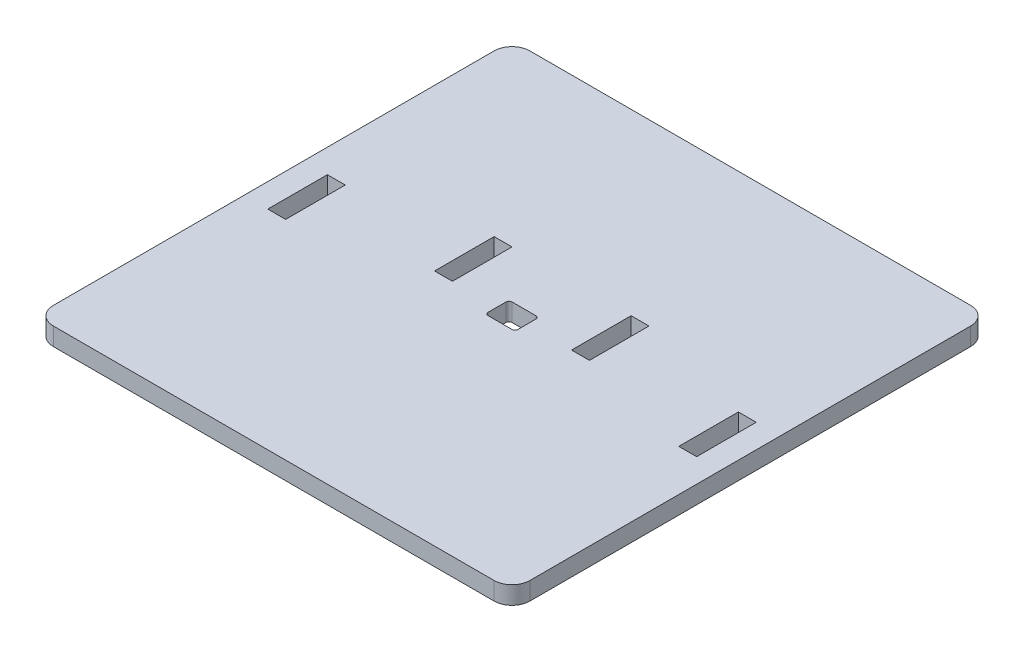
ISO-10303-21;
HEADER;
FILE_DESCRIPTION(('STEP AP214'),'2;1');
FILE_NAME('part.step','',(''),(''),'','','');
FILE_SCHEMA(('AUTOMOTIVE_DESIGN { 1 0 10303 214 1 1 1 1 }'));
ENDSEC;
DATA;
#1=APPLICATION_CONTEXT('core data for automotive mechanical design processes');
#2=APPLICATION_PROTOCOL_DEFINITION('international standard','automotive_design',2000,#1);
#3=PRODUCT_CONTEXT('',#1,'mechanical');
#4=PRODUCT('Part','Part','',(#3));
#5=PRODUCT_RELATED_PRODUCT_CATEGORY('part','',(#4));
#6=PRODUCT_DEFINITION_FORMATION('','',#4);
#7=PRODUCT_DEFINITION_CONTEXT('part definition',#1,'design');
#8=PRODUCT_DEFINITION('design','',#6,#7);
#9=PRODUCT_DEFINITION_SHAPE('','',#8);
#10=(LENGTH_UNIT() NAMED_UNIT(*) SI_UNIT(.MILLI.,.METRE.));
#11=(NAMED_UNIT(*) PLANE_ANGLE_UNIT() SI_UNIT($,.RADIAN.));
#12=(NAMED_UNIT(*) SI_UNIT($,.STERADIAN.) SOLID_ANGLE_UNIT());
#13=UNCERTAINTY_MEASURE_WITH_UNIT(LENGTH_MEASURE(1.E-05),#10,'distance_accuracy_value','');
#14=(GEOMETRIC_REPRESENTATION_CONTEXT(3) GLOBAL_UNCERTAINTY_ASSIGNED_CONTEXT((#13)) GLOBAL_UNIT_ASSIGNED_CONTEXT((#10,
#11,#12)) REPRESENTATION_CONTEXT('',''));
#15=CARTESIAN_POINT('',(0.,0.,0.));
#16=DIRECTION('',(0.,0.,1.));
#17=DIRECTION('',(1.,0.,0.));
#18=AXIS2_PLACEMENT_3D('',#15,#16,#17);
#19=CARTESIAN_POINT('',(74.,6.,-154.));
#20=DIRECTION('',(0.,-1.,0.));
#21=DIRECTION('',(0.,0.,-1.));
#22=AXIS2_PLACEMENT_3D('',#19,#20,#21);
#23=PLANE('',#22);
#24=DIRECTION('',(0.,0.,-1.));
#25=VECTOR('',#24,1.);
#26=CARTESIAN_POINT('',(-5.00000000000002,6.,-154.));
#27=LINE('',#26,#25);
#28=CARTESIAN_POINT('',(-5.,6.,-77.));
#29=VERTEX_POINT('',#28);
#30=CARTESIAN_POINT('',(-5.,6.,-83.));
#31=VERTEX_POINT('',#30);
#32=EDGE_CURVE('E568',#29,#31,#27,.T.);
#33=ORIENTED_EDGE('',*,*,#32,.T.);
#34=CARTESIAN_POINT('',(-4.,6.,-83.));
#35=DIRECTION('',(0.,-1.,0.));
#36=DIRECTION('',(0.,0.,-1.));
#37=AXIS2_PLACEMENT_3D('',#34,#35,#36);
#38=CIRCLE('',#37,1.);
#39=CARTESIAN_POINT('',(-4.,6.,-84.));
#40=VERTEX_POINT('',#39);
#41=EDGE_CURVE('E47',#31,#40,#38,.T.);
#42=ORIENTED_EDGE('',*,*,#41,.T.);
#43=DIRECTION('',(1.,0.,0.));
#44=VECTOR('',#43,1.);
#45=CARTESIAN_POINT('',(74.,6.,-84.));
#46=LINE('',#45,#44);
#47=CARTESIAN_POINT('',(4.,6.,-84.));
#48=VERTEX_POINT('',#47);
#49=EDGE_CURVE('E566',#40,#48,#46,.T.);
#50=ORIENTED_EDGE('',*,*,#49,.T.);
#51=CARTESIAN_POINT('',(4.,6.,-83.));
#52=DIRECTION('',(0.,-1.,0.));
#53=DIRECTION('',(0.,0.,-1.));
#54=AXIS2_PLACEMENT_3D('',#51,#52,#53);
#55=CIRCLE('',#54,1.);
#56=CARTESIAN_POINT('',(5.,6.,-83.));
#57=VERTEX_POINT('',#56);
#58=EDGE_CURVE('E54',#48,#57,#55,.T.);
#59=ORIENTED_EDGE('',*,*,#58,.T.);
#60=DIRECTION('',(0.,0.,1.));
#61=VECTOR('',#60,1.);
#62=CARTESIAN_POINT('',(5.,6.,-154.));
#63=LINE('',#62,#61);
#64=CARTESIAN_POINT('',(5.,6.,-77.));
#65=VERTEX_POINT('',#64);
#66=EDGE_CURVE('E279',#57,#65,#63,.T.);
#67=ORIENTED_EDGE('',*,*,#66,.T.);
#68=CARTESIAN_POINT('',(4.,6.,-77.));
#69=DIRECTION('',(0.,-1.,0.));
#70=DIRECTION('',(0.,0.,-1.));
#71=AXIS2_PLACEMENT_3D('',#68,#69,#70);
#72=CIRCLE('',#71,1.);
#73=CARTESIAN_POINT('',(4.,6.,-76.));
#74=VERTEX_POINT('',#73);
#75=EDGE_CURVE('E465',#65,#74,#72,.T.);
#76=ORIENTED_EDGE('',*,*,#75,.T.);
#77=DIRECTION('',(-1.,0.,0.));
#78=VECTOR('',#77,1.);
#79=CARTESIAN_POINT('',(74.,6.,-76.));
#80=LINE('',#79,#78);
#81=CARTESIAN_POINT('',(-3.99999999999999,6.,-76.));
#82=VERTEX_POINT('',#81);
#83=EDGE_CURVE('E569',#74,#82,#80,.T.);
#84=ORIENTED_EDGE('',*,*,#83,.T.);
#85=CARTESIAN_POINT('',(-4.,6.,-77.));
#86=DIRECTION('',(0.,-1.,0.));
#87=DIRECTION('',(0.,0.,-1.));
#88=AXIS2_PLACEMENT_3D('',#85,#86,#87);
#89=CIRCLE('',#88,1.);
#90=EDGE_CURVE('E469',#82,#29,#89,.T.);
#91=ORIENTED_EDGE('',*,*,#90,.T.);
#92=EDGE_LOOP('',(#33,#42,#50,#59,#67,#76,#84,#91));
#93=FACE_BOUND('',#92,.T.);
#94=DIRECTION('',(1.,0.,0.));
#95=VECTOR('',#94,1.);
#96=CARTESIAN_POINT('',(-26.,6.,-80.));
#97=LINE('',#96,#95);
#98=CARTESIAN_POINT('',(-26.,6.,-80.));
#99=VERTEX_POINT('',#98);
#100=CARTESIAN_POINT('',(-20.,6.,-80.));
#101=VERTEX_POINT('',#100);
#102=EDGE_CURVE('E285',#99,#101,#97,.T.);
#103=ORIENTED_EDGE('',*,*,#102,.F.);
#104=DIRECTION('',(0.,0.,1.));
#105=VECTOR('',#104,1.);
#106=CARTESIAN_POINT('',(-26.,6.,-80.));
#107=LINE('',#106,#105);
#108=CARTESIAN_POINT('',(-26.,6.,-100.));
#109=VERTEX_POINT('',#108);
#110=EDGE_CURVE('E255',#109,#99,#107,.T.);
#111=ORIENTED_EDGE('',*,*,#110,.F.);
#112=DIRECTION('',(-1.,0.,0.));
#113=VECTOR('',#112,1.);
#114=CARTESIAN_POINT('',(-26.,6.,-100.));
#115=LINE('',#114,#113);
#116=CARTESIAN_POINT('',(-20.,6.,-100.));
#117=VERTEX_POINT('',#116);
#118=EDGE_CURVE('E273',#117,#109,#115,.T.);
#119=ORIENTED_EDGE('',*,*,#118,.F.);
#120=DIRECTION('',(0.,0.,-1.));
#121=VECTOR('',#120,1.);
#122=CARTESIAN_POINT('',(-20.,6.,-80.));
#123=LINE('',#122,#121);
#124=EDGE_CURVE('E276',#101,#117,#123,.T.);
#125=ORIENTED_EDGE('',*,*,#124,.F.);
#126=EDGE_LOOP('',(#103,#111,#119,#125));
#127=FACE_BOUND('',#126,.T.);
#128=DIRECTION('',(-1.,0.,0.));
#129=VECTOR('',#128,1.);
#130=CARTESIAN_POINT('',(26.,6.,-100.));
#131=LINE('',#130,#129);
#132=CARTESIAN_POINT('',(26.,6.,-100.));
#133=VERTEX_POINT('',#132);
#134=CARTESIAN_POINT('',(20.,6.,-100.));
#135=VERTEX_POINT('',#134);
#136=EDGE_CURVE('E313',#133,#135,#131,.T.);
#137=ORIENTED_EDGE('',*,*,#136,.F.);
#138=DIRECTION('',(0.,0.,-1.));
#139=VECTOR('',#138,1.);
#140=CARTESIAN_POINT('',(26.,6.,-80.));
#141=LINE('',#140,#139);
#142=CARTESIAN_POINT('',(26.,6.,-80.));
#143=VERTEX_POINT('',#142);
#144=EDGE_CURVE('E286',#143,#133,#141,.T.);
#145=ORIENTED_EDGE('',*,*,#144,.F.);
#146=DIRECTION('',(1.,0.,0.));
#147=VECTOR('',#146,1.);
#148=CARTESIAN_POINT('',(26.,6.,-80.));
#149=LINE('',#148,#147);
#150=CARTESIAN_POINT('',(20.,6.,-80.));
#151=VERTEX_POINT('',#150);
#152=EDGE_CURVE('E306',#151,#143,#149,.T.);
#153=ORIENTED_EDGE('',*,*,#152,.F.);
#154=DIRECTION('',(0.,0.,1.));
#155=VECTOR('',#154,1.);
#156=CARTESIAN_POINT('',(20.,6.,-80.));
#157=LINE('',#156,#155);
#158=EDGE_CURVE('E309',#135,#151,#157,.T.);
#159=ORIENTED_EDGE('',*,*,#158,.F.);
#160=EDGE_LOOP('',(#137,#145,#153,#159));
#161=FACE_BOUND('',#160,.T.);
#162=DIRECTION('',(0.,0.,1.));
#163=VECTOR('',#162,1.);
#164=CARTESIAN_POINT('',(-72.,6.,-90.));
#165=LINE('',#164,#163);
#166=CARTESIAN_POINT('',(-72.,6.,-90.));
#167=VERTEX_POINT('',#166);
#168=CARTESIAN_POINT('',(-72.,6.,-70.));
#169=VERTEX_POINT('',#168);
#170=EDGE_CURVE('E358',#167,#169,#165,.T.);
#171=ORIENTED_EDGE('',*,*,#170,.F.);
#172=DIRECTION('',(-1.,0.,0.));
#173=VECTOR('',#172,1.);
#174=CARTESIAN_POINT('',(-72.,6.,-90.));
#175=LINE('',#174,#173);
#176=CARTESIAN_POINT('',(-66.,6.,-90.));
#177=VERTEX_POINT('',#176);
#178=EDGE_CURVE('E366',#177,#167,#175,.T.);
#179=ORIENTED_EDGE('',*,*,#178,.F.);
#180=DIRECTION('',(0.,0.,-1.));
#181=VECTOR('',#180,1.);
#182=CARTESIAN_POINT('',(-66.,6.,-90.));
#183=LINE('',#182,#181);
#184=CARTESIAN_POINT('',(-66.,6.,-70.));
#185=VERTEX_POINT('',#184);
#186=EDGE_CURVE('E363',#185,#177,#183,.T.);
#187=ORIENTED_EDGE('',*,*,#186,.F.);
#188=DIRECTION('',(1.,0.,0.));
#189=VECTOR('',#188,1.);
#190=CARTESIAN_POINT('',(-72.,6.,-70.));
#191=LINE('',#190,#189);
#192=EDGE_CURVE('E360',#169,#185,#191,.T.);
#193=ORIENTED_EDGE('',*,*,#192,.F.);
#194=EDGE_LOOP('',(#171,#179,#187,#193));
#195=FACE_BOUND('',#194,.T.);
#196=CARTESIAN_POINT('',(74.,6.,-154.));
#197=DIRECTION('',(0.,1.,0.));
#198=DIRECTION('',(0.,0.,-1.));
#199=AXIS2_PLACEMENT_3D('',#196,#197,#198);
#200=CIRCLE('',#199,5.99999999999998);
#201=CARTESIAN_POINT('',(80.,6.,-154.));
#202=VERTEX_POINT('',#201);
#203=CARTESIAN_POINT('',(74.,6.,-160.));
#204=VERTEX_POINT('',#203);
#205=EDGE_CURVE('E389',#202,#204,#200,.T.);
#206=ORIENTED_EDGE('',*,*,#205,.T.);
#207=DIRECTION('',(-1.,0.,0.));
#208=VECTOR('',#207,1.);
#209=CARTESIAN_POINT('',(-74.,6.,-160.));
#210=LINE('',#209,#208);
#211=CARTESIAN_POINT('',(-74.,6.,-160.));
#212=VERTEX_POINT('',#211);
#213=EDGE_CURVE('E392',#204,#212,#210,.T.);
#214=ORIENTED_EDGE('',*,*,#213,.T.);
#215=CARTESIAN_POINT('',(-74.,6.,-154.));
#216=DIRECTION('',(0.,1.,0.));
#217=DIRECTION('',(0.,0.,-1.));
#218=AXIS2_PLACEMENT_3D('',#215,#216,#217);
#219=CIRCLE('',#218,5.99999999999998);
#220=CARTESIAN_POINT('',(-80.,6.,-154.));
#221=VERTEX_POINT('',#220);
#222=EDGE_CURVE('E395',#212,#221,#219,.T.);
#223=ORIENTED_EDGE('',*,*,#222,.T.);
#224=DIRECTION('',(0.,0.,1.));
#225=VECTOR('',#224,1.);
#226=CARTESIAN_POINT('',(-80.,6.,-6.00000000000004));
#227=LINE('',#226,#225);
#228=CARTESIAN_POINT('',(-80.,6.,-6.00000000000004));
#229=VERTEX_POINT('',#228);
#230=EDGE_CURVE('E397',#221,#229,#227,.T.);
#231=ORIENTED_EDGE('',*,*,#230,.T.);
#232=CARTESIAN_POINT('',(-74.,6.,-6.));
#233=DIRECTION('',(0.,1.,0.));
#234=DIRECTION('',(0.,0.,-1.));
#235=AXIS2_PLACEMENT_3D('',#232,#233,#234);
#236=CIRCLE('',#235,6.);
#237=CARTESIAN_POINT('',(-74.,6.,0.));
#238=VERTEX_POINT('',#237);
#239=EDGE_CURVE('E399',#229,#238,#236,.T.);
#240=ORIENTED_EDGE('',*,*,#239,.T.);
#241=DIRECTION('',(1.,0.,0.));
#242=VECTOR('',#241,1.);
#243=CARTESIAN_POINT('',(-74.,6.,0.));
#244=LINE('',#243,#242);
#245=CARTESIAN_POINT('',(74.,6.,0.));
#246=VERTEX_POINT('',#245);
#247=EDGE_CURVE('E401',#238,#246,#244,.T.);
#248=ORIENTED_EDGE('',*,*,#247,.T.);
#249=CARTESIAN_POINT('',(74.,6.,-6.00000000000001));
#250=DIRECTION('',(0.,1.,0.));
#251=DIRECTION('',(0.,0.,1.));
#252=AXIS2_PLACEMENT_3D('',#249,#250,#251);
#253=CIRCLE('',#252,6.);
#254=CARTESIAN_POINT('',(80.,6.,-6.00000000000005));
#255=VERTEX_POINT('',#254);
#256=EDGE_CURVE('E403',#246,#255,#253,.T.);
#257=ORIENTED_EDGE('',*,*,#256,.T.);
#258=DIRECTION('',(0.,0.,-1.));
#259=VECTOR('',#258,1.);
#260=CARTESIAN_POINT('',(80.,6.,-6.00000000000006));
#261=LINE('',#260,#259);
#262=EDGE_CURVE('E405',#255,#202,#261,.T.);
#263=ORIENTED_EDGE('',*,*,#262,.T.);
#264=EDGE_LOOP('',(#206,#214,#223,#231,#240,#248,#257,#263));
#265=FACE_BOUND('',#264,.T.);
#266=DIRECTION('',(0.,0.,-1.));
#267=VECTOR('',#266,1.);
#268=CARTESIAN_POINT('',(72.,6.,-90.));
#269=LINE('',#268,#267);
#270=CARTESIAN_POINT('',(72.,6.,-70.));
#271=VERTEX_POINT('',#270);
#272=CARTESIAN_POINT('',(72.,6.,-90.));
#273=VERTEX_POINT('',#272);
#274=EDGE_CURVE('E327',#271,#273,#269,.T.);
#275=ORIENTED_EDGE('',*,*,#274,.F.);
#276=DIRECTION('',(1.,0.,0.));
#277=VECTOR('',#276,1.);
#278=CARTESIAN_POINT('',(72.,6.,-70.));
#279=LINE('',#278,#277);
#280=CARTESIAN_POINT('',(66.,6.,-70.));
#281=VERTEX_POINT('',#280);
#282=EDGE_CURVE('E335',#281,#271,#279,.T.);
#283=ORIENTED_EDGE('',*,*,#282,.F.);
#284=DIRECTION('',(0.,0.,1.));
#285=VECTOR('',#284,1.);
#286=CARTESIAN_POINT('',(66.,6.,-90.));
#287=LINE('',#286,#285);
#288=CARTESIAN_POINT('',(66.,6.,-90.));
#289=VERTEX_POINT('',#288);
#290=EDGE_CURVE('E332',#289,#281,#287,.T.);
#291=ORIENTED_EDGE('',*,*,#290,.F.);
#292=DIRECTION('',(-1.,0.,0.));
#293=VECTOR('',#292,1.);
#294=CARTESIAN_POINT('',(72.,6.,-90.));
#295=LINE('',#294,#293);
#296=EDGE_CURVE('E329',#273,#289,#295,.T.);
#297=ORIENTED_EDGE('',*,*,#296,.F.);
#298=EDGE_LOOP('',(#275,#283,#291,#297));
#299=FACE_BOUND('',#298,.T.);
#300=ADVANCED_FACE('F39',(#93,#127,#161,#195,#265,#299),#23,.F.);
#301=CARTESIAN_POINT('',(74.,0.,-154.));
#302=DIRECTION('',(0.,-1.,0.));
#303=DIRECTION('',(0.,0.,-1.));
#304=AXIS2_PLACEMENT_3D('',#301,#302,#303);
#305=PLANE('',#304);
#306=DIRECTION('',(1.,0.,0.));
#307=VECTOR('',#306,1.);
#308=CARTESIAN_POINT('',(-5.,0.,-76.));
#309=LINE('',#308,#307);
#310=CARTESIAN_POINT('',(-4.,0.,-76.));
#311=VERTEX_POINT('',#310);
#312=CARTESIAN_POINT('',(4.00000000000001,0.,-76.));
#313=VERTEX_POINT('',#312);
#314=EDGE_CURVE('E556',#311,#313,#309,.T.);
#315=ORIENTED_EDGE('',*,*,#314,.T.);
#316=CARTESIAN_POINT('',(4.,0.,-77.));
#317=DIRECTION('',(0.,-1.,0.));
#318=DIRECTION('',(0.,0.,-1.));
#319=AXIS2_PLACEMENT_3D('',#316,#317,#318);
#320=CIRCLE('',#319,1.);
#321=CARTESIAN_POINT('',(5.,0.,-77.));
#322=VERTEX_POINT('',#321);
#323=EDGE_CURVE('E467',#313,#322,#320,.F.);
#324=ORIENTED_EDGE('',*,*,#323,.T.);
#325=DIRECTION('',(0.,0.,-1.));
#326=VECTOR('',#325,1.);
#327=CARTESIAN_POINT('',(5.,0.,-84.));
#328=LINE('',#327,#326);
#329=CARTESIAN_POINT('',(5.,0.,-83.));
#330=VERTEX_POINT('',#329);
#331=EDGE_CURVE('E484',#322,#330,#328,.T.);
#332=ORIENTED_EDGE('',*,*,#331,.T.);
#333=CARTESIAN_POINT('',(4.,0.,-83.));
#334=DIRECTION('',(0.,-1.,0.));
#335=DIRECTION('',(0.,0.,-1.));
#336=AXIS2_PLACEMENT_3D('',#333,#334,#335);
#337=CIRCLE('',#336,1.);
#338=CARTESIAN_POINT('',(4.,0.,-84.));
#339=VERTEX_POINT('',#338);
#340=EDGE_CURVE('E474',#330,#339,#337,.F.);
#341=ORIENTED_EDGE('',*,*,#340,.T.);
#342=DIRECTION('',(-1.,0.,0.));
#343=VECTOR('',#342,1.);
#344=CARTESIAN_POINT('',(-5.,0.,-84.));
#345=LINE('',#344,#343);
#346=CARTESIAN_POINT('',(-4.,0.,-84.));
#347=VERTEX_POINT('',#346);
#348=EDGE_CURVE('E481',#339,#347,#345,.T.);
#349=ORIENTED_EDGE('',*,*,#348,.T.);
#350=CARTESIAN_POINT('',(-4.,0.,-83.));
#351=DIRECTION('',(0.,-1.,0.));
#352=DIRECTION('',(0.,0.,-1.));
#353=AXIS2_PLACEMENT_3D('',#350,#351,#352);
#354=CIRCLE('',#353,1.);
#355=CARTESIAN_POINT('',(-5.,0.,-83.));
#356=VERTEX_POINT('',#355);
#357=EDGE_CURVE('E11',#347,#356,#354,.F.);
#358=ORIENTED_EDGE('',*,*,#357,.T.);
#359=DIRECTION('',(0.,0.,1.));
#360=VECTOR('',#359,1.);
#361=CARTESIAN_POINT('',(-5.,0.,-84.));
#362=LINE('',#361,#360);
#363=CARTESIAN_POINT('',(-5.,0.,-77.));
#364=VERTEX_POINT('',#363);
#365=EDGE_CURVE('E488',#356,#364,#362,.T.);
#366=ORIENTED_EDGE('',*,*,#365,.T.);
#367=CARTESIAN_POINT('',(-4.,0.,-77.));
#368=DIRECTION('',(0.,-1.,0.));
#369=DIRECTION('',(0.,0.,-1.));
#370=AXIS2_PLACEMENT_3D('',#367,#368,#369);
#371=CIRCLE('',#370,1.);
#372=EDGE_CURVE('E471',#364,#311,#371,.F.);
#373=ORIENTED_EDGE('',*,*,#372,.T.);
#374=EDGE_LOOP('',(#315,#324,#332,#341,#349,#358,#366,#373));
#375=FACE_BOUND('',#374,.T.);
#376=DIRECTION('',(0.,0.,1.));
#377=VECTOR('',#376,1.);
#378=CARTESIAN_POINT('',(-26.,0.,-80.));
#379=LINE('',#378,#377);
#380=CARTESIAN_POINT('',(-26.,0.,-100.));
#381=VERTEX_POINT('',#380);
#382=CARTESIAN_POINT('',(-26.,0.,-80.));
#383=VERTEX_POINT('',#382);
#384=EDGE_CURVE('E252',#381,#383,#379,.T.);
#385=ORIENTED_EDGE('',*,*,#384,.T.);
#386=DIRECTION('',(1.,0.,0.));
#387=VECTOR('',#386,1.);
#388=CARTESIAN_POINT('',(-26.,0.,-80.));
#389=LINE('',#388,#387);
#390=CARTESIAN_POINT('',(-20.,0.,-80.));
#391=VERTEX_POINT('',#390);
#392=EDGE_CURVE('E264',#383,#391,#389,.T.);
#393=ORIENTED_EDGE('',*,*,#392,.T.);
#394=DIRECTION('',(0.,0.,-1.));
#395=VECTOR('',#394,1.);
#396=CARTESIAN_POINT('',(-20.,0.,-80.));
#397=LINE('',#396,#395);
#398=CARTESIAN_POINT('',(-20.,0.,-100.));
#399=VERTEX_POINT('',#398);
#400=EDGE_CURVE('E268',#391,#399,#397,.T.);
#401=ORIENTED_EDGE('',*,*,#400,.T.);
#402=DIRECTION('',(-1.,0.,0.));
#403=VECTOR('',#402,1.);
#404=CARTESIAN_POINT('',(-26.,0.,-100.));
#405=LINE('',#404,#403);
#406=EDGE_CURVE('E260',#399,#381,#405,.T.);
#407=ORIENTED_EDGE('',*,*,#406,.T.);
#408=EDGE_LOOP('',(#385,#393,#401,#407));
#409=FACE_BOUND('',#408,.T.);
#410=DIRECTION('',(0.,0.,-1.));
#411=VECTOR('',#410,1.);
#412=CARTESIAN_POINT('',(26.,0.,-80.));
#413=LINE('',#412,#411);
#414=CARTESIAN_POINT('',(26.,0.,-80.));
#415=VERTEX_POINT('',#414);
#416=CARTESIAN_POINT('',(26.,0.,-100.));
#417=VERTEX_POINT('',#416);
#418=EDGE_CURVE('E310',#415,#417,#413,.T.);
#419=ORIENTED_EDGE('',*,*,#418,.T.);
#420=DIRECTION('',(-1.,0.,0.));
#421=VECTOR('',#420,1.);
#422=CARTESIAN_POINT('',(26.,0.,-100.));
#423=LINE('',#422,#421);
#424=CARTESIAN_POINT('',(20.,0.,-100.));
#425=VERTEX_POINT('',#424);
#426=EDGE_CURVE('E322',#417,#425,#423,.T.);
#427=ORIENTED_EDGE('',*,*,#426,.T.);
#428=DIRECTION('',(0.,0.,1.));
#429=VECTOR('',#428,1.);
#430=CARTESIAN_POINT('',(20.,0.,-80.));
#431=LINE('',#430,#429);
#432=CARTESIAN_POINT('',(20.,0.,-80.));
#433=VERTEX_POINT('',#432);
#434=EDGE_CURVE('E319',#425,#433,#431,.T.);
#435=ORIENTED_EDGE('',*,*,#434,.T.);
#436=DIRECTION('',(1.,0.,0.));
#437=VECTOR('',#436,1.);
#438=CARTESIAN_POINT('',(26.,0.,-80.));
#439=LINE('',#438,#437);
#440=EDGE_CURVE('E299',#433,#415,#439,.T.);
#441=ORIENTED_EDGE('',*,*,#440,.T.);
#442=EDGE_LOOP('',(#419,#427,#435,#441));
#443=FACE_BOUND('',#442,.T.);
#444=CARTESIAN_POINT('',(74.,0.,-154.));
#445=DIRECTION('',(0.,1.,0.));
#446=DIRECTION('',(0.,0.,-1.));
#447=AXIS2_PLACEMENT_3D('',#444,#445,#446);
#448=CIRCLE('',#447,5.99999999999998);
#449=CARTESIAN_POINT('',(80.,0.,-154.));
#450=VERTEX_POINT('',#449);
#451=CARTESIAN_POINT('',(74.,0.,-160.));
#452=VERTEX_POINT('',#451);
#453=EDGE_CURVE('E388',#450,#452,#448,.T.);
#454=ORIENTED_EDGE('',*,*,#453,.F.);
#455=DIRECTION('',(0.,0.,-1.));
#456=VECTOR('',#455,1.);
#457=CARTESIAN_POINT('',(80.,0.,-6.00000000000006));
#458=LINE('',#457,#456);
#459=CARTESIAN_POINT('',(80.,0.,-6.00000000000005));
#460=VERTEX_POINT('',#459);
#461=EDGE_CURVE('E393',#460,#450,#458,.T.);
#462=ORIENTED_EDGE('',*,*,#461,.F.);
#463=CARTESIAN_POINT('',(74.,0.,-6.00000000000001));
#464=DIRECTION('',(0.,1.,0.));
#465=DIRECTION('',(0.,0.,1.));
#466=AXIS2_PLACEMENT_3D('',#463,#464,#465);
#467=CIRCLE('',#466,6.);
#468=CARTESIAN_POINT('',(74.,0.,0.));
#469=VERTEX_POINT('',#468);
#470=EDGE_CURVE('E420',#469,#460,#467,.T.);
#471=ORIENTED_EDGE('',*,*,#470,.F.);
#472=DIRECTION('',(1.,0.,0.));
#473=VECTOR('',#472,1.);
#474=CARTESIAN_POINT('',(-74.,0.,0.));
#475=LINE('',#474,#473);
#476=CARTESIAN_POINT('',(-74.,0.,0.));
#477=VERTEX_POINT('',#476);
#478=EDGE_CURVE('E418',#477,#469,#475,.T.);
#479=ORIENTED_EDGE('',*,*,#478,.F.);
#480=CARTESIAN_POINT('',(-74.,0.,-6.));
#481=DIRECTION('',(0.,1.,0.));
#482=DIRECTION('',(0.,0.,-1.));
#483=AXIS2_PLACEMENT_3D('',#480,#481,#482);
#484=CIRCLE('',#483,6.);
#485=CARTESIAN_POINT('',(-80.,0.,-6.00000000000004));
#486=VERTEX_POINT('',#485);
#487=EDGE_CURVE('E416',#486,#477,#484,.T.);
#488=ORIENTED_EDGE('',*,*,#487,.F.);
#489=DIRECTION('',(0.,0.,1.));
#490=VECTOR('',#489,1.);
#491=CARTESIAN_POINT('',(-80.,0.,-6.00000000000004));
#492=LINE('',#491,#490);
#493=CARTESIAN_POINT('',(-80.,0.,-154.));
#494=VERTEX_POINT('',#493);
#495=EDGE_CURVE('E414',#494,#486,#492,.T.);
#496=ORIENTED_EDGE('',*,*,#495,.F.);
#497=CARTESIAN_POINT('',(-74.,0.,-154.));
#498=DIRECTION('',(0.,1.,0.));
#499=DIRECTION('',(0.,0.,-1.));
#500=AXIS2_PLACEMENT_3D('',#497,#498,#499);
#501=CIRCLE('',#500,5.99999999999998);
#502=CARTESIAN_POINT('',(-74.,0.,-160.));
#503=VERTEX_POINT('',#502);
#504=EDGE_CURVE('E412',#503,#494,#501,.T.);
#505=ORIENTED_EDGE('',*,*,#504,.F.);
#506=DIRECTION('',(-1.,0.,0.));
#507=VECTOR('',#506,1.);
#508=CARTESIAN_POINT('',(-74.,0.,-160.));
#509=LINE('',#508,#507);
#510=EDGE_CURVE('E410',#452,#503,#509,.T.);
#511=ORIENTED_EDGE('',*,*,#510,.F.);
#512=EDGE_LOOP('',(#454,#462,#471,#479,#488,#496,#505,#511));
#513=FACE_BOUND('',#512,.T.);
#514=DIRECTION('',(-1.,0.,0.));
#515=VECTOR('',#514,1.);
#516=CARTESIAN_POINT('',(-72.,0.,-90.));
#517=LINE('',#516,#515);
#518=CARTESIAN_POINT('',(-66.,0.,-90.));
#519=VERTEX_POINT('',#518);
#520=CARTESIAN_POINT('',(-72.,0.,-90.));
#521=VERTEX_POINT('',#520);
#522=EDGE_CURVE('E361',#519,#521,#517,.T.);
#523=ORIENTED_EDGE('',*,*,#522,.T.);
#524=DIRECTION('',(0.,0.,1.));
#525=VECTOR('',#524,1.);
#526=CARTESIAN_POINT('',(-72.,0.,-90.));
#527=LINE('',#526,#525);
#528=CARTESIAN_POINT('',(-72.,0.,-70.));
#529=VERTEX_POINT('',#528);
#530=EDGE_CURVE('E357',#521,#529,#527,.T.);
#531=ORIENTED_EDGE('',*,*,#530,.T.);
#532=DIRECTION('',(1.,0.,0.));
#533=VECTOR('',#532,1.);
#534=CARTESIAN_POINT('',(-72.,0.,-70.));
#535=LINE('',#534,#533);
#536=CARTESIAN_POINT('',(-66.,0.,-70.));
#537=VERTEX_POINT('',#536);
#538=EDGE_CURVE('E371',#529,#537,#535,.T.);
#539=ORIENTED_EDGE('',*,*,#538,.T.);
#540=DIRECTION('',(0.,0.,-1.));
#541=VECTOR('',#540,1.);
#542=CARTESIAN_POINT('',(-66.,0.,-90.));
#543=LINE('',#542,#541);
#544=EDGE_CURVE('E374',#537,#519,#543,.T.);
#545=ORIENTED_EDGE('',*,*,#544,.T.);
#546=EDGE_LOOP('',(#523,#531,#539,#545));
#547=FACE_BOUND('',#546,.T.);
#548=DIRECTION('',(1.,0.,0.));
#549=VECTOR('',#548,1.);
#550=CARTESIAN_POINT('',(72.,0.,-70.));
#551=LINE('',#550,#549);
#552=CARTESIAN_POINT('',(66.,0.,-70.));
#553=VERTEX_POINT('',#552);
#554=CARTESIAN_POINT('',(72.,0.,-70.));
#555=VERTEX_POINT('',#554);
#556=EDGE_CURVE('E330',#553,#555,#551,.T.);
#557=ORIENTED_EDGE('',*,*,#556,.T.);
#558=DIRECTION('',(0.,0.,-1.));
#559=VECTOR('',#558,1.);
#560=CARTESIAN_POINT('',(72.,0.,-90.));
#561=LINE('',#560,#559);
#562=CARTESIAN_POINT('',(72.,0.,-90.));
#563=VERTEX_POINT('',#562);
#564=EDGE_CURVE('E292',#555,#563,#561,.T.);
#565=ORIENTED_EDGE('',*,*,#564,.T.);
#566=DIRECTION('',(-1.,0.,0.));
#567=VECTOR('',#566,1.);
#568=CARTESIAN_POINT('',(72.,0.,-90.));
#569=LINE('',#568,#567);
#570=CARTESIAN_POINT('',(66.,0.,-90.));
#571=VERTEX_POINT('',#570);
#572=EDGE_CURVE('E340',#563,#571,#569,.T.);
#573=ORIENTED_EDGE('',*,*,#572,.T.);
#574=DIRECTION('',(0.,0.,1.));
#575=VECTOR('',#574,1.);
#576=CARTESIAN_POINT('',(66.,0.,-90.));
#577=LINE('',#576,#575);
#578=EDGE_CURVE('E343',#571,#553,#577,.T.);
#579=ORIENTED_EDGE('',*,*,#578,.T.);
#580=EDGE_LOOP('',(#557,#565,#573,#579));
#581=FACE_BOUND('',#580,.T.);
#582=ADVANCED_FACE('F270',(#375,#409,#443,#513,#547,#581),#305,.T.);
#583=CARTESIAN_POINT('',(74.,6.,-154.));
#584=DIRECTION('',(0.,-1.,0.));
#585=DIRECTION('',(0.,0.,-1.));
#586=AXIS2_PLACEMENT_3D('',#583,#584,#585);
#587=CYLINDRICAL_SURFACE('',#586,5.99999999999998);
#588=ORIENTED_EDGE('',*,*,#453,.T.);
#589=DIRECTION('',(0.,-1.,0.));
#590=VECTOR('',#589,1.);
#591=CARTESIAN_POINT('',(74.,6.,-160.));
#592=LINE('',#591,#590);
#593=EDGE_CURVE('E443',#204,#452,#592,.T.);
#594=ORIENTED_EDGE('',*,*,#593,.F.);
#595=ORIENTED_EDGE('',*,*,#205,.F.);
#596=DIRECTION('',(0.,-1.,0.));
#597=VECTOR('',#596,1.);
#598=CARTESIAN_POINT('',(80.,6.,-154.));
#599=LINE('',#598,#597);
#600=EDGE_CURVE('E407',#202,#450,#599,.T.);
#601=ORIENTED_EDGE('',*,*,#600,.T.);
#602=EDGE_LOOP('',(#588,#594,#595,#601));
#603=FACE_BOUND('',#602,.T.);
#604=ADVANCED_FACE('F507',(#603),#587,.T.);
#605=CARTESIAN_POINT('',(-74.,6.,-160.));
#606=DIRECTION('',(0.,0.,1.));
#607=DIRECTION('',(1.,0.,0.));
#608=AXIS2_PLACEMENT_3D('',#605,#606,#607);
#609=PLANE('',#608);
#610=ORIENTED_EDGE('',*,*,#510,.T.);
#611=DIRECTION('',(0.,-1.,0.));
#612=VECTOR('',#611,1.);
#613=CARTESIAN_POINT('',(-74.,6.,-160.));
#614=LINE('',#613,#612);
#615=EDGE_CURVE('E440',#212,#503,#614,.T.);
#616=ORIENTED_EDGE('',*,*,#615,.F.);
#617=ORIENTED_EDGE('',*,*,#213,.F.);
#618=ORIENTED_EDGE('',*,*,#593,.T.);
#619=EDGE_LOOP('',(#610,#616,#617,#618));
#620=FACE_BOUND('',#619,.T.);
#621=ADVANCED_FACE('F537',(#620),#609,.F.);
#622=CARTESIAN_POINT('',(-74.,6.,-154.));
#623=DIRECTION('',(0.,-1.,0.));
#624=DIRECTION('',(0.,0.,-1.));
#625=AXIS2_PLACEMENT_3D('',#622,#623,#624);
#626=CYLINDRICAL_SURFACE('',#625,5.99999999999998);
#627=ORIENTED_EDGE('',*,*,#504,.T.);
#628=DIRECTION('',(0.,-1.,0.));
#629=VECTOR('',#628,1.);
#630=CARTESIAN_POINT('',(-80.,6.,-154.));
#631=LINE('',#630,#629);
#632=EDGE_CURVE('E437',#221,#494,#631,.T.);
#633=ORIENTED_EDGE('',*,*,#632,.F.);
#634=ORIENTED_EDGE('',*,*,#222,.F.);
#635=ORIENTED_EDGE('',*,*,#615,.T.);
#636=EDGE_LOOP('',(#627,#633,#634,#635));
#637=FACE_BOUND('',#636,.T.);
#638=ADVANCED_FACE('F533',(#637),#626,.T.);
#639=CARTESIAN_POINT('',(-80.,6.,-6.00000000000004));
#640=DIRECTION('',(1.,0.,0.));
#641=DIRECTION('',(0.,0.,-1.));
#642=AXIS2_PLACEMENT_3D('',#639,#640,#641);
#643=PLANE('',#642);
#644=ORIENTED_EDGE('',*,*,#495,.T.);
#645=DIRECTION('',(0.,-1.,0.));
#646=VECTOR('',#645,1.);
#647=CARTESIAN_POINT('',(-80.,6.,-6.00000000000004));
#648=LINE('',#647,#646);
#649=EDGE_CURVE('E434',#229,#486,#648,.T.);
#650=ORIENTED_EDGE('',*,*,#649,.F.);
#651=ORIENTED_EDGE('',*,*,#230,.F.);
#652=ORIENTED_EDGE('',*,*,#632,.T.);
#653=EDGE_LOOP('',(#644,#650,#651,#652));
#654=FACE_BOUND('',#653,.T.);
#655=ADVANCED_FACE('F529',(#654),#643,.F.);
#656=CARTESIAN_POINT('',(-74.,6.,-6.));
#657=DIRECTION('',(0.,-1.,0.));
#658=DIRECTION('',(0.,0.,-1.));
#659=AXIS2_PLACEMENT_3D('',#656,#657,#658);
#660=CYLINDRICAL_SURFACE('',#659,6.);
#661=ORIENTED_EDGE('',*,*,#487,.T.);
#662=DIRECTION('',(0.,-1.,0.));
#663=VECTOR('',#662,1.);
#664=CARTESIAN_POINT('',(-74.,6.,0.));
#665=LINE('',#664,#663);
#666=EDGE_CURVE('E431',#238,#477,#665,.T.);
#667=ORIENTED_EDGE('',*,*,#666,.F.);
#668=ORIENTED_EDGE('',*,*,#239,.F.);
#669=ORIENTED_EDGE('',*,*,#649,.T.);
#670=EDGE_LOOP('',(#661,#667,#668,#669));
#671=FACE_BOUND('',#670,.T.);
#672=ADVANCED_FACE('F525',(#671),#660,.T.);
#673=CARTESIAN_POINT('',(-74.,6.,0.));
#674=DIRECTION('',(0.,0.,-1.));
#675=DIRECTION('',(-1.,0.,0.));
#676=AXIS2_PLACEMENT_3D('',#673,#674,#675);
#677=PLANE('',#676);
#678=ORIENTED_EDGE('',*,*,#478,.T.);
#679=DIRECTION('',(0.,-1.,0.));
#680=VECTOR('',#679,1.);
#681=CARTESIAN_POINT('',(74.,6.,0.));
#682=LINE('',#681,#680);
#683=EDGE_CURVE('E428',#246,#469,#682,.T.);
#684=ORIENTED_EDGE('',*,*,#683,.F.);
#685=ORIENTED_EDGE('',*,*,#247,.F.);
#686=ORIENTED_EDGE('',*,*,#666,.T.);
#687=EDGE_LOOP('',(#678,#684,#685,#686));
#688=FACE_BOUND('',#687,.T.);
#689=ADVANCED_FACE('F521',(#688),#677,.F.);
#690=CARTESIAN_POINT('',(74.,6.,-6.00000000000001));
#691=DIRECTION('',(0.,-1.,0.));
#692=DIRECTION('',(0.,0.,-1.));
#693=AXIS2_PLACEMENT_3D('',#690,#691,#692);
#694=CYLINDRICAL_SURFACE('',#693,6.);
#695=ORIENTED_EDGE('',*,*,#470,.T.);
#696=DIRECTION('',(0.,-1.,0.));
#697=VECTOR('',#696,1.);
#698=CARTESIAN_POINT('',(80.,6.,-6.00000000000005));
#699=LINE('',#698,#697);
#700=EDGE_CURVE('E425',#255,#460,#699,.T.);
#701=ORIENTED_EDGE('',*,*,#700,.F.);
#702=ORIENTED_EDGE('',*,*,#256,.F.);
#703=ORIENTED_EDGE('',*,*,#683,.T.);
#704=EDGE_LOOP('',(#695,#701,#702,#703));
#705=FACE_BOUND('',#704,.T.);
#706=ADVANCED_FACE('F517',(#705),#694,.T.);
#707=CARTESIAN_POINT('',(80.,6.,-6.00000000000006));
#708=DIRECTION('',(-1.,0.,0.));
#709=DIRECTION('',(0.,0.,1.));
#710=AXIS2_PLACEMENT_3D('',#707,#708,#709);
#711=PLANE('',#710);
#712=ORIENTED_EDGE('',*,*,#461,.T.);
#713=ORIENTED_EDGE('',*,*,#600,.F.);
#714=ORIENTED_EDGE('',*,*,#262,.F.);
#715=ORIENTED_EDGE('',*,*,#700,.T.);
#716=EDGE_LOOP('',(#712,#713,#714,#715));
#717=FACE_BOUND('',#716,.T.);
#718=ADVANCED_FACE('F514',(#717),#711,.F.);
#719=CARTESIAN_POINT('',(-72.,6.,-90.));
#720=DIRECTION('',(1.,0.,0.));
#721=DIRECTION('',(0.,0.,-1.));
#722=AXIS2_PLACEMENT_3D('',#719,#720,#721);
#723=PLANE('',#722);
#724=ORIENTED_EDGE('',*,*,#530,.F.);
#725=DIRECTION('',(0.,-1.,0.));
#726=VECTOR('',#725,1.);
#727=CARTESIAN_POINT('',(-72.,6.,-90.));
#728=LINE('',#727,#726);
#729=EDGE_CURVE('E368',#167,#521,#728,.T.);
#730=ORIENTED_EDGE('',*,*,#729,.F.);
#731=ORIENTED_EDGE('',*,*,#170,.T.);
#732=DIRECTION('',(0.,-1.,0.));
#733=VECTOR('',#732,1.);
#734=CARTESIAN_POINT('',(-72.,6.,-70.));
#735=LINE('',#734,#733);
#736=EDGE_CURVE('E385',#169,#529,#735,.T.);
#737=ORIENTED_EDGE('',*,*,#736,.T.);
#738=EDGE_LOOP('',(#724,#730,#731,#737));
#739=FACE_BOUND('',#738,.T.);
#740=ADVANCED_FACE('F511',(#739),#723,.T.);
#741=CARTESIAN_POINT('',(-72.,6.,-70.));
#742=DIRECTION('',(0.,0.,-1.));
#743=DIRECTION('',(-1.,0.,0.));
#744=AXIS2_PLACEMENT_3D('',#741,#742,#743);
#745=PLANE('',#744);
#746=ORIENTED_EDGE('',*,*,#538,.F.);
#747=ORIENTED_EDGE('',*,*,#736,.F.);
#748=ORIENTED_EDGE('',*,*,#192,.T.);
#749=DIRECTION('',(0.,-1.,0.));
#750=VECTOR('',#749,1.);
#751=CARTESIAN_POINT('',(-66.,6.,-70.));
#752=LINE('',#751,#750);
#753=EDGE_CURVE('E383',#185,#537,#752,.T.);
#754=ORIENTED_EDGE('',*,*,#753,.T.);
#755=EDGE_LOOP('',(#746,#747,#748,#754));
#756=FACE_BOUND('',#755,.T.);
#757=ADVANCED_FACE('F639',(#756),#745,.T.);
#758=CARTESIAN_POINT('',(-66.,6.,-90.));
#759=DIRECTION('',(-1.,0.,0.));
#760=DIRECTION('',(0.,0.,1.));
#761=AXIS2_PLACEMENT_3D('',#758,#759,#760);
#762=PLANE('',#761);
#763=ORIENTED_EDGE('',*,*,#544,.F.);
#764=ORIENTED_EDGE('',*,*,#753,.F.);
#765=ORIENTED_EDGE('',*,*,#186,.T.);
#766=DIRECTION('',(0.,-1.,0.));
#767=VECTOR('',#766,1.);
#768=CARTESIAN_POINT('',(-66.,6.,-90.));
#769=LINE('',#768,#767);
#770=EDGE_CURVE('E381',#177,#519,#769,.T.);
#771=ORIENTED_EDGE('',*,*,#770,.T.);
#772=EDGE_LOOP('',(#763,#764,#765,#771));
#773=FACE_BOUND('',#772,.T.);
#774=ADVANCED_FACE('F636',(#773),#762,.T.);
#775=CARTESIAN_POINT('',(-72.,6.,-90.));
#776=DIRECTION('',(0.,0.,1.));
#777=DIRECTION('',(1.,0.,0.));
#778=AXIS2_PLACEMENT_3D('',#775,#776,#777);
#779=PLANE('',#778);
#780=ORIENTED_EDGE('',*,*,#522,.F.);
#781=ORIENTED_EDGE('',*,*,#770,.F.);
#782=ORIENTED_EDGE('',*,*,#178,.T.);
#783=ORIENTED_EDGE('',*,*,#729,.T.);
#784=EDGE_LOOP('',(#780,#781,#782,#783));
#785=FACE_BOUND('',#784,.T.);
#786=ADVANCED_FACE('F632',(#785),#779,.T.);
#787=CARTESIAN_POINT('',(72.,6.,-90.));
#788=DIRECTION('',(-1.,0.,0.));
#789=DIRECTION('',(0.,0.,1.));
#790=AXIS2_PLACEMENT_3D('',#787,#788,#789);
#791=PLANE('',#790);
#792=ORIENTED_EDGE('',*,*,#564,.F.);
#793=DIRECTION('',(0.,-1.,0.));
#794=VECTOR('',#793,1.);
#795=CARTESIAN_POINT('',(72.,6.,-70.));
#796=LINE('',#795,#794);
#797=EDGE_CURVE('E337',#271,#555,#796,.T.);
#798=ORIENTED_EDGE('',*,*,#797,.F.);
#799=ORIENTED_EDGE('',*,*,#274,.T.);
#800=DIRECTION('',(0.,-1.,0.));
#801=VECTOR('',#800,1.);
#802=CARTESIAN_POINT('',(72.,6.,-90.));
#803=LINE('',#802,#801);
#804=EDGE_CURVE('E354',#273,#563,#803,.T.);
#805=ORIENTED_EDGE('',*,*,#804,.T.);
#806=EDGE_LOOP('',(#792,#798,#799,#805));
#807=FACE_BOUND('',#806,.T.);
#808=ADVANCED_FACE('F628',(#807),#791,.T.);
#809=CARTESIAN_POINT('',(72.,6.,-90.));
#810=DIRECTION('',(0.,0.,1.));
#811=DIRECTION('',(1.,0.,0.));
#812=AXIS2_PLACEMENT_3D('',#809,#810,#811);
#813=PLANE('',#812);
#814=ORIENTED_EDGE('',*,*,#572,.F.);
#815=ORIENTED_EDGE('',*,*,#804,.F.);
#816=ORIENTED_EDGE('',*,*,#296,.T.);
#817=DIRECTION('',(0.,-1.,0.));
#818=VECTOR('',#817,1.);
#819=CARTESIAN_POINT('',(66.,6.,-90.));
#820=LINE('',#819,#818);
#821=EDGE_CURVE('E352',#289,#571,#820,.T.);
#822=ORIENTED_EDGE('',*,*,#821,.T.);
#823=EDGE_LOOP('',(#814,#815,#816,#822));
#824=FACE_BOUND('',#823,.T.);
#825=ADVANCED_FACE('F624',(#824),#813,.T.);
#826=CARTESIAN_POINT('',(66.,6.,-90.));
#827=DIRECTION('',(1.,0.,0.));
#828=DIRECTION('',(0.,0.,-1.));
#829=AXIS2_PLACEMENT_3D('',#826,#827,#828);
#830=PLANE('',#829);
#831=ORIENTED_EDGE('',*,*,#578,.F.);
#832=ORIENTED_EDGE('',*,*,#821,.F.);
#833=ORIENTED_EDGE('',*,*,#290,.T.);
#834=DIRECTION('',(0.,-1.,0.));
#835=VECTOR('',#834,1.);
#836=CARTESIAN_POINT('',(66.,6.,-70.));
#837=LINE('',#836,#835);
#838=EDGE_CURVE('E350',#281,#553,#837,.T.);
#839=ORIENTED_EDGE('',*,*,#838,.T.);
#840=EDGE_LOOP('',(#831,#832,#833,#839));
#841=FACE_BOUND('',#840,.T.);
#842=ADVANCED_FACE('F620',(#841),#830,.T.);
#843=CARTESIAN_POINT('',(72.,6.,-70.));
#844=DIRECTION('',(0.,0.,-1.));
#845=DIRECTION('',(-1.,0.,0.));
#846=AXIS2_PLACEMENT_3D('',#843,#844,#845);
#847=PLANE('',#846);
#848=ORIENTED_EDGE('',*,*,#556,.F.);
#849=ORIENTED_EDGE('',*,*,#838,.F.);
#850=ORIENTED_EDGE('',*,*,#282,.T.);
#851=ORIENTED_EDGE('',*,*,#797,.T.);
#852=EDGE_LOOP('',(#848,#849,#850,#851));
#853=FACE_BOUND('',#852,.T.);
#854=ADVANCED_FACE('F606',(#853),#847,.T.);
#855=CARTESIAN_POINT('',(26.,0.,-80.));
#856=DIRECTION('',(1.,0.,0.));
#857=DIRECTION('',(0.,0.,-1.));
#858=AXIS2_PLACEMENT_3D('',#855,#856,#857);
#859=PLANE('',#858);
#860=ORIENTED_EDGE('',*,*,#144,.T.);
#861=DIRECTION('',(0.,1.,0.));
#862=VECTOR('',#861,1.);
#863=CARTESIAN_POINT('',(26.,0.,-100.));
#864=LINE('',#863,#862);
#865=EDGE_CURVE('E296',#417,#133,#864,.T.);
#866=ORIENTED_EDGE('',*,*,#865,.F.);
#867=ORIENTED_EDGE('',*,*,#418,.F.);
#868=DIRECTION('',(0.,1.,0.));
#869=VECTOR('',#868,1.);
#870=CARTESIAN_POINT('',(26.,0.,-80.));
#871=LINE('',#870,#869);
#872=EDGE_CURVE('E304',#415,#143,#871,.T.);
#873=ORIENTED_EDGE('',*,*,#872,.T.);
#874=EDGE_LOOP('',(#860,#866,#867,#873));
#875=FACE_BOUND('',#874,.T.);
#876=ADVANCED_FACE('F602',(#875),#859,.F.);
#877=CARTESIAN_POINT('',(26.,0.,-80.));
#878=DIRECTION('',(0.,0.,1.));
#879=DIRECTION('',(1.,0.,0.));
#880=AXIS2_PLACEMENT_3D('',#877,#878,#879);
#881=PLANE('',#880);
#882=ORIENTED_EDGE('',*,*,#152,.T.);
#883=ORIENTED_EDGE('',*,*,#872,.F.);
#884=ORIENTED_EDGE('',*,*,#440,.F.);
#885=DIRECTION('',(0.,1.,0.));
#886=VECTOR('',#885,1.);
#887=CARTESIAN_POINT('',(20.,0.,-80.));
#888=LINE('',#887,#886);
#889=EDGE_CURVE('E302',#433,#151,#888,.T.);
#890=ORIENTED_EDGE('',*,*,#889,.T.);
#891=EDGE_LOOP('',(#882,#883,#884,#890));
#892=FACE_BOUND('',#891,.T.);
#893=ADVANCED_FACE('F605',(#892),#881,.F.);
#894=CARTESIAN_POINT('',(20.,0.,-80.));
#895=DIRECTION('',(-1.,0.,0.));
#896=DIRECTION('',(0.,0.,1.));
#897=AXIS2_PLACEMENT_3D('',#894,#895,#896);
#898=PLANE('',#897);
#899=ORIENTED_EDGE('',*,*,#158,.T.);
#900=ORIENTED_EDGE('',*,*,#889,.F.);
#901=ORIENTED_EDGE('',*,*,#434,.F.);
#902=DIRECTION('',(0.,1.,0.));
#903=VECTOR('',#902,1.);
#904=CARTESIAN_POINT('',(20.,0.,-100.));
#905=LINE('',#904,#903);
#906=EDGE_CURVE('E300',#425,#135,#905,.T.);
#907=ORIENTED_EDGE('',*,*,#906,.T.);
#908=EDGE_LOOP('',(#899,#900,#901,#907));
#909=FACE_BOUND('',#908,.T.);
#910=ADVANCED_FACE('F610',(#909),#898,.F.);
#911=CARTESIAN_POINT('',(26.,0.,-100.));
#912=DIRECTION('',(0.,0.,-1.));
#913=DIRECTION('',(-1.,0.,0.));
#914=AXIS2_PLACEMENT_3D('',#911,#912,#913);
#915=PLANE('',#914);
#916=ORIENTED_EDGE('',*,*,#136,.T.);
#917=ORIENTED_EDGE('',*,*,#906,.F.);
#918=ORIENTED_EDGE('',*,*,#426,.F.);
#919=ORIENTED_EDGE('',*,*,#865,.T.);
#920=EDGE_LOOP('',(#916,#917,#918,#919));
#921=FACE_BOUND('',#920,.T.);
#922=ADVANCED_FACE('F601',(#921),#915,.F.);
#923=CARTESIAN_POINT('',(-26.,0.,-80.));
#924=DIRECTION('',(-1.,0.,0.));
#925=DIRECTION('',(0.,0.,1.));
#926=AXIS2_PLACEMENT_3D('',#923,#924,#925);
#927=PLANE('',#926);
#928=ORIENTED_EDGE('',*,*,#110,.T.);
#929=DIRECTION('',(0.,1.,0.));
#930=VECTOR('',#929,1.);
#931=CARTESIAN_POINT('',(-26.,0.,-80.));
#932=LINE('',#931,#930);
#933=EDGE_CURVE('E248',#383,#99,#932,.T.);
#934=ORIENTED_EDGE('',*,*,#933,.F.);
#935=ORIENTED_EDGE('',*,*,#384,.F.);
#936=DIRECTION('',(0.,1.,0.));
#937=VECTOR('',#936,1.);
#938=CARTESIAN_POINT('',(-26.,0.,-100.));
#939=LINE('',#938,#937);
#940=EDGE_CURVE('E290',#381,#109,#939,.T.);
#941=ORIENTED_EDGE('',*,*,#940,.T.);
#942=EDGE_LOOP('',(#928,#934,#935,#941));
#943=FACE_BOUND('',#942,.T.);
#944=ADVANCED_FACE('F250',(#943),#927,.F.);
#945=CARTESIAN_POINT('',(-26.,0.,-100.));
#946=DIRECTION('',(0.,0.,-1.));
#947=DIRECTION('',(-1.,0.,0.));
#948=AXIS2_PLACEMENT_3D('',#945,#946,#947);
#949=PLANE('',#948);
#950=ORIENTED_EDGE('',*,*,#118,.T.);
#951=ORIENTED_EDGE('',*,*,#940,.F.);
#952=ORIENTED_EDGE('',*,*,#406,.F.);
#953=DIRECTION('',(0.,1.,0.));
#954=VECTOR('',#953,1.);
#955=CARTESIAN_POINT('',(-20.,0.,-100.));
#956=LINE('',#955,#954);
#957=EDGE_CURVE('E293',#399,#117,#956,.T.);
#958=ORIENTED_EDGE('',*,*,#957,.T.);
#959=EDGE_LOOP('',(#950,#951,#952,#958));
#960=FACE_BOUND('',#959,.T.);
#961=ADVANCED_FACE('F590',(#960),#949,.F.);
#962=CARTESIAN_POINT('',(-20.,0.,-80.));
#963=DIRECTION('',(1.,0.,0.));
#964=DIRECTION('',(0.,0.,-1.));
#965=AXIS2_PLACEMENT_3D('',#962,#963,#964);
#966=PLANE('',#965);
#967=ORIENTED_EDGE('',*,*,#124,.T.);
#968=ORIENTED_EDGE('',*,*,#957,.F.);
#969=ORIENTED_EDGE('',*,*,#400,.F.);
#970=DIRECTION('',(0.,1.,0.));
#971=VECTOR('',#970,1.);
#972=CARTESIAN_POINT('',(-20.,0.,-80.));
#973=LINE('',#972,#971);
#974=EDGE_CURVE('E259',#391,#101,#973,.T.);
#975=ORIENTED_EDGE('',*,*,#974,.T.);
#976=EDGE_LOOP('',(#967,#968,#969,#975));
#977=FACE_BOUND('',#976,.T.);
#978=ADVANCED_FACE('F593',(#977),#966,.F.);
#979=CARTESIAN_POINT('',(-26.,0.,-80.));
#980=DIRECTION('',(0.,0.,1.));
#981=DIRECTION('',(1.,0.,0.));
#982=AXIS2_PLACEMENT_3D('',#979,#980,#981);
#983=PLANE('',#982);
#984=ORIENTED_EDGE('',*,*,#102,.T.);
#985=ORIENTED_EDGE('',*,*,#974,.F.);
#986=ORIENTED_EDGE('',*,*,#392,.F.);
#987=ORIENTED_EDGE('',*,*,#933,.T.);
#988=EDGE_LOOP('',(#984,#985,#986,#987));
#989=FACE_BOUND('',#988,.T.);
#990=ADVANCED_FACE('F265',(#989),#983,.F.);
#991=CARTESIAN_POINT('',(5.,0.,-84.));
#992=DIRECTION('',(1.,0.,0.));
#993=DIRECTION('',(0.,0.,-1.));
#994=AXIS2_PLACEMENT_3D('',#991,#992,#993);
#995=PLANE('',#994);
#996=ORIENTED_EDGE('',*,*,#331,.F.);
#997=DIRECTION('',(0.,1.,0.));
#998=VECTOR('',#997,1.);
#999=CARTESIAN_POINT('',(5.,6.,-77.));
#1000=LINE('',#999,#998);
#1001=EDGE_CURVE('E448',#322,#65,#1000,.T.);
#1002=ORIENTED_EDGE('',*,*,#1001,.T.);
#1003=ORIENTED_EDGE('',*,*,#66,.F.);
#1004=DIRECTION('',(0.,1.,0.));
#1005=VECTOR('',#1004,1.);
#1006=CARTESIAN_POINT('',(5.,0.,-83.));
#1007=LINE('',#1006,#1005);
#1008=EDGE_CURVE('E446',#57,#330,#1007,.F.);
#1009=ORIENTED_EDGE('',*,*,#1008,.T.);
#1010=EDGE_LOOP('',(#996,#1002,#1003,#1009));
#1011=FACE_BOUND('',#1010,.T.);
#1012=ADVANCED_FACE('F558',(#1011),#995,.F.);
#1013=CARTESIAN_POINT('',(-5.,0.,-76.));
#1014=DIRECTION('',(0.,0.,1.));
#1015=DIRECTION('',(1.,0.,0.));
#1016=AXIS2_PLACEMENT_3D('',#1013,#1014,#1015);
#1017=PLANE('',#1016);
#1018=ORIENTED_EDGE('',*,*,#83,.F.);
#1019=DIRECTION('',(0.,1.,0.));
#1020=VECTOR('',#1019,1.);
#1021=CARTESIAN_POINT('',(4.,0.,-76.));
#1022=LINE('',#1021,#1020);
#1023=EDGE_CURVE('E454',#74,#313,#1022,.F.);
#1024=ORIENTED_EDGE('',*,*,#1023,.T.);
#1025=ORIENTED_EDGE('',*,*,#314,.F.);
#1026=DIRECTION('',(0.,1.,0.));
#1027=VECTOR('',#1026,1.);
#1028=CARTESIAN_POINT('',(-4.,6.,-76.));
#1029=LINE('',#1028,#1027);
#1030=EDGE_CURVE('E451',#311,#82,#1029,.T.);
#1031=ORIENTED_EDGE('',*,*,#1030,.T.);
#1032=EDGE_LOOP('',(#1018,#1024,#1025,#1031));
#1033=FACE_BOUND('',#1032,.T.);
#1034=ADVANCED_FACE('F580',(#1033),#1017,.F.);
#1035=CARTESIAN_POINT('',(-5.,0.,-84.));
#1036=DIRECTION('',(-1.,0.,0.));
#1037=DIRECTION('',(0.,0.,1.));
#1038=AXIS2_PLACEMENT_3D('',#1035,#1036,#1037);
#1039=PLANE('',#1038);
#1040=ORIENTED_EDGE('',*,*,#32,.F.);
#1041=DIRECTION('',(0.,1.,0.));
#1042=VECTOR('',#1041,1.);
#1043=CARTESIAN_POINT('',(-5.,0.,-77.));
#1044=LINE('',#1043,#1042);
#1045=EDGE_CURVE('E459',#29,#364,#1044,.F.);
#1046=ORIENTED_EDGE('',*,*,#1045,.T.);
#1047=ORIENTED_EDGE('',*,*,#365,.F.);
#1048=DIRECTION('',(0.,1.,0.));
#1049=VECTOR('',#1048,1.);
#1050=CARTESIAN_POINT('',(-5.,6.,-83.));
#1051=LINE('',#1050,#1049);
#1052=EDGE_CURVE('E456',#356,#31,#1051,.T.);
#1053=ORIENTED_EDGE('',*,*,#1052,.T.);
#1054=EDGE_LOOP('',(#1040,#1046,#1047,#1053));
#1055=FACE_BOUND('',#1054,.T.);
#1056=ADVANCED_FACE('F550',(#1055),#1039,.F.);
#1057=CARTESIAN_POINT('',(-5.,0.,-84.));
#1058=DIRECTION('',(0.,0.,-1.));
#1059=DIRECTION('',(-1.,0.,0.));
#1060=AXIS2_PLACEMENT_3D('',#1057,#1058,#1059);
#1061=PLANE('',#1060);
#1062=ORIENTED_EDGE('',*,*,#348,.F.);
#1063=DIRECTION('',(0.,1.,0.));
#1064=VECTOR('',#1063,1.);
#1065=CARTESIAN_POINT('',(4.,6.,-84.));
#1066=LINE('',#1065,#1064);
#1067=EDGE_CURVE('E463',#339,#48,#1066,.T.);
#1068=ORIENTED_EDGE('',*,*,#1067,.T.);
#1069=ORIENTED_EDGE('',*,*,#49,.F.);
#1070=DIRECTION('',(0.,1.,0.));
#1071=VECTOR('',#1070,1.);
#1072=CARTESIAN_POINT('',(-4.,0.,-84.));
#1073=LINE('',#1072,#1071);
#1074=EDGE_CURVE('E461',#40,#347,#1073,.F.);
#1075=ORIENTED_EDGE('',*,*,#1074,.T.);
#1076=EDGE_LOOP('',(#1062,#1068,#1069,#1075));
#1077=FACE_BOUND('',#1076,.T.);
#1078=ADVANCED_FACE('F486',(#1077),#1061,.F.);
#1079=CARTESIAN_POINT('',(4.,0.,-77.));
#1080=DIRECTION('',(0.,-1.,0.));
#1081=DIRECTION('',(0.,0.,-1.));
#1082=AXIS2_PLACEMENT_3D('',#1079,#1080,#1081);
#1083=CYLINDRICAL_SURFACE('',#1082,1.);
#1084=ORIENTED_EDGE('',*,*,#323,.F.);
#1085=ORIENTED_EDGE('',*,*,#1023,.F.);
#1086=ORIENTED_EDGE('',*,*,#75,.F.);
#1087=ORIENTED_EDGE('',*,*,#1001,.F.);
#1088=EDGE_LOOP('',(#1084,#1085,#1086,#1087));
#1089=FACE_BOUND('',#1088,.T.);
#1090=ADVANCED_FACE('F498',(#1089),#1083,.F.);
#1091=CARTESIAN_POINT('',(-4.,0.,-77.));
#1092=DIRECTION('',(0.,-1.,0.));
#1093=DIRECTION('',(0.,0.,-1.));
#1094=AXIS2_PLACEMENT_3D('',#1091,#1092,#1093);
#1095=CYLINDRICAL_SURFACE('',#1094,1.);
#1096=ORIENTED_EDGE('',*,*,#372,.F.);
#1097=ORIENTED_EDGE('',*,*,#1045,.F.);
#1098=ORIENTED_EDGE('',*,*,#90,.F.);
#1099=ORIENTED_EDGE('',*,*,#1030,.F.);
#1100=EDGE_LOOP('',(#1096,#1097,#1098,#1099));
#1101=FACE_BOUND('',#1100,.T.);
#1102=ADVANCED_FACE('F492',(#1101),#1095,.F.);
#1103=CARTESIAN_POINT('',(4.,0.,-83.));
#1104=DIRECTION('',(0.,-1.,0.));
#1105=DIRECTION('',(0.,0.,-1.));
#1106=AXIS2_PLACEMENT_3D('',#1103,#1104,#1105);
#1107=CYLINDRICAL_SURFACE('',#1106,1.);
#1108=ORIENTED_EDGE('',*,*,#340,.F.);
#1109=ORIENTED_EDGE('',*,*,#1008,.F.);
#1110=ORIENTED_EDGE('',*,*,#58,.F.);
#1111=ORIENTED_EDGE('',*,*,#1067,.F.);
#1112=EDGE_LOOP('',(#1108,#1109,#1110,#1111));
#1113=FACE_BOUND('',#1112,.T.);
#1114=ADVANCED_FACE('F490',(#1113),#1107,.F.);
#1115=CARTESIAN_POINT('',(-4.,0.,-83.));
#1116=DIRECTION('',(0.,-1.,0.));
#1117=DIRECTION('',(0.,0.,-1.));
#1118=AXIS2_PLACEMENT_3D('',#1115,#1116,#1117);
#1119=CYLINDRICAL_SURFACE('',#1118,1.);
#1120=ORIENTED_EDGE('',*,*,#357,.F.);
#1121=ORIENTED_EDGE('',*,*,#1074,.F.);
#1122=ORIENTED_EDGE('',*,*,#41,.F.);
#1123=ORIENTED_EDGE('',*,*,#1052,.F.);
#1124=EDGE_LOOP('',(#1120,#1121,#1122,#1123));
#1125=FACE_BOUND('',#1124,.T.);
#1126=ADVANCED_FACE('F41',(#1125),#1119,.F.);
#1127=CLOSED_SHELL('',(#300,#582,#604,#621,#638,#655,#672,#689,#706,#718,#740,#757,#774,#786,
#808,#825,#842,#854,#876,#893,#910,#922,#944,#961,#978,#990,#1012,#1034,#1056,#1078,#1090,#1102,
#1114,#1126));
#1128=MANIFOLD_SOLID_BREP('B2',#1127);
#1129=ADVANCED_BREP_SHAPE_REPRESENTATION('',(#18,#1128),#14);
#1130=SHAPE_DEFINITION_REPRESENTATION(#9,#1129);
ENDSEC;
END-ISO-10303-21;
